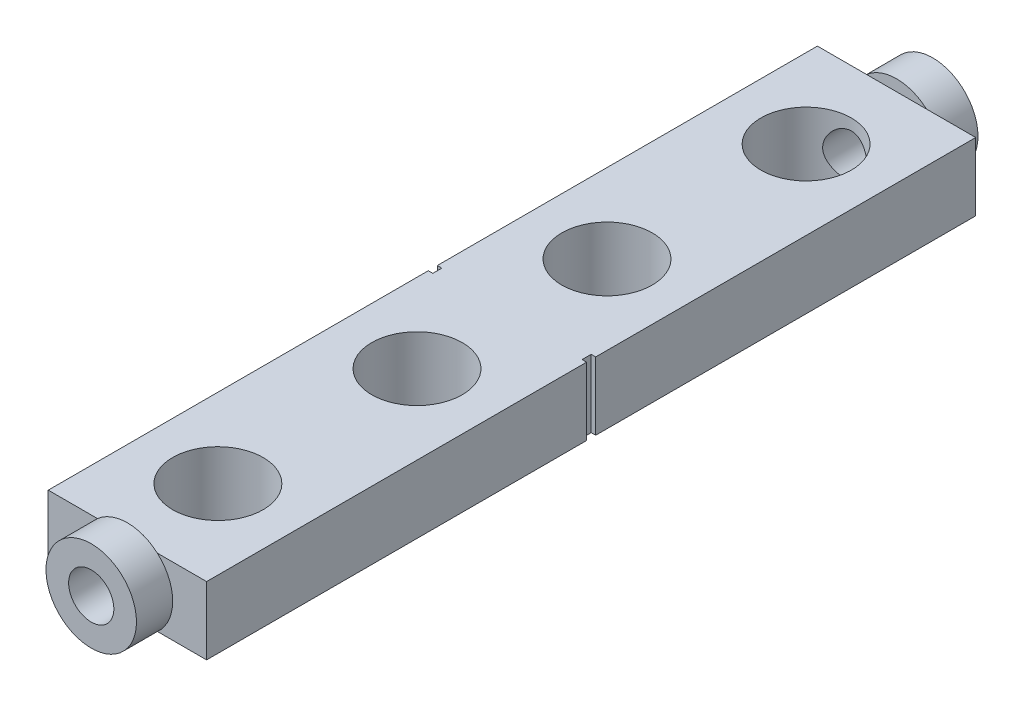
from build123d import *

# Parameters (mm, degrees)
ESQUISSE2_R           = 1
EXTRUSION1_DEPTH      = 0.75
ESQUISSE3_R           = 1
EXTRUSION2_DEPTH      = 0.8
EXTRUSION3_REACH      = 11.516
EXTRUSION3_END_RADIUS = 1
ESQUISSE6_R           = 0.5


with BuildPart() as part:
    # Esquisse2 → Extrusion1 (new, symmetric)
    with BuildSketch(Plane(origin=(0, 0, 0), x_dir=(1, 0, 0), z_dir=(0, 1, 0))):
        Polygon((-1.65, 0), (1.65, 0), (1.65, -0.1), (1.75, -0.1), (1.75, -8.5), (-1.75, -8.5), (-1.75, -0.1), (-1.65, -0.1), align=None)
        with Locations(Location((0, -6.5, 0), (0, 0, 270))):
            Circle(ESQUISSE2_R, mode=Mode.SUBTRACT)
        with Locations(Location((0, -2.1, 0), (0, 0, 90))):
            Circle(ESQUISSE2_R, mode=Mode.SUBTRACT)
    extrude(amount=EXTRUSION1_DEPTH, both=True)

    # Esquisse3 → Extrusion2 (add)
    with BuildSketch(Plane.XY.offset(8.5)):
        with Locations(Location((0, 0, 0), (0, 0, 131.409622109))):
            Circle(ESQUISSE3_R)
    extrude(amount=EXTRUSION2_DEPTH)

    # Extrusion3: up to this cylinder (the profile starts outside it)
    extrusion3_end = Plane(origin=(0, 0, 6.5), z_dir=(0, -1, 0)) * Cylinder(EXTRUSION3_END_RADIUS, 26.032, mode=Mode.PRIVATE)
    # Esquisse6 → Extrusion3 (cut, up to the surface)
    with BuildSketch(Plane.XY.offset(9.3), mode=Mode.PRIVATE) as extrusion3_sk1:
        Circle(ESQUISSE6_R)
    extrusion3_tool1 = extrude(extrusion3_sk1.sketch, amount=-EXTRUSION3_REACH, mode=Mode.PRIVATE) - extrusion3_end
    add(extrusion3_tool1.solids().sort_by_distance((0, 0, 9.3))[0], mode=Mode.SUBTRACT)

    # Sym_trie1: part across plane


with BuildPart() as part_1:
    add(part.part)
    add(part.part.mirror(Plane(origin=(-1.65, 0.75, 0), x_dir=(1, 0, 0), z_dir=(0, 0, 1))))


solid = part_1.part
